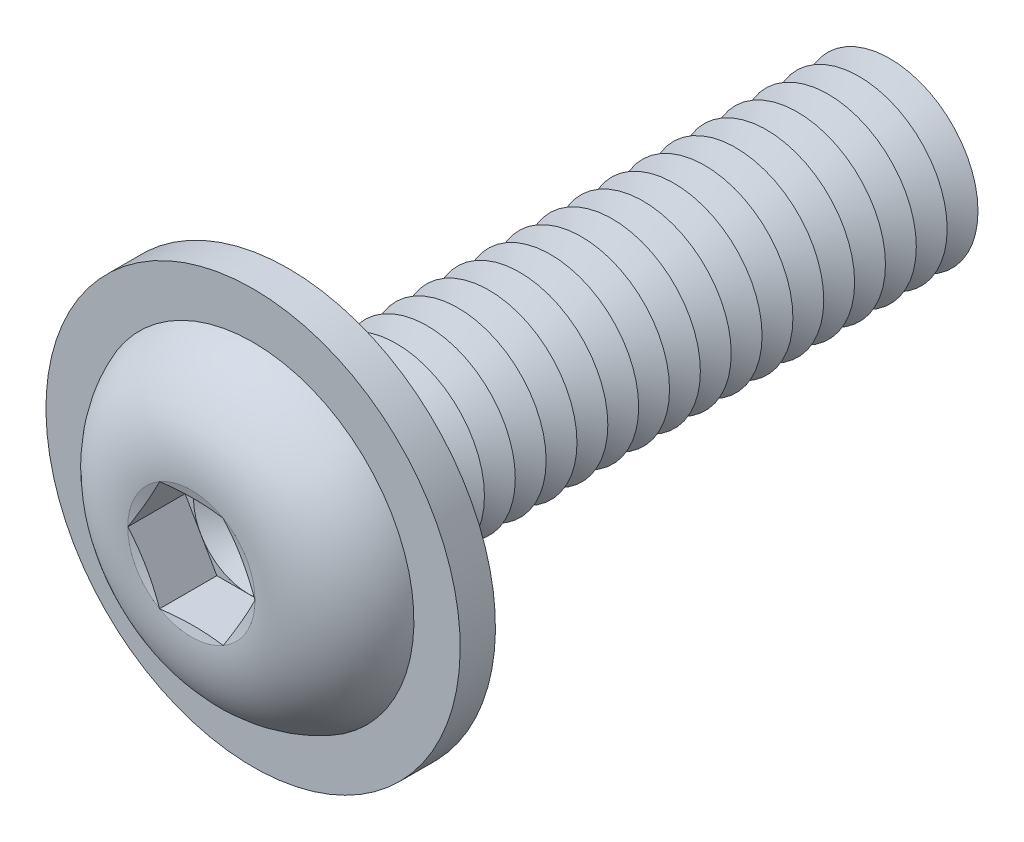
from build123d import *

# Parameters (mm, degrees)
FILLET1_R           = 0.35
LPATTERN1_COUNT     = 20
LPATTERN1_PITCH     = 0.7
CUT_EXTRUDE1_DEPTH  = 1.3
SKETCH5_R           = 4.7
SKETCH5_R_2         = 2.35
BOSS_EXTRUDE1_DEPTH = 0.8


with BuildPart() as part:
    # Sketch1 → Revolve1 (revolve)
    with BuildSketch(Plane(origin=(0, 0, 0), x_dir=(0, 0, -1), z_dir=(1, 0, 0)), mode=Mode.PRIVATE) as revolve1_sk:
        with BuildLine():
            Line((0, 2), (0, 3.8))
            ThreePointArc((0, 3.8), (-1.611961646, 3.099623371), (-2.2, 1.443375))
            Line((-2.2, 1.443375), (-2.006624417, 0.7216875))
            Line((-2.006624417, 0.7216875), (-2.2, 0.7216875))
            Line((-2.2, 0.7216875), (-2.2, 0))
            Line((-2.2, 0), (14, 0))
            Line((14, 0), (14, 2))
            Line((14, 2), (0, 2))
        make_face()
    revolve(revolve1_sk.sketch.rotate(Axis((0, 0, -14), (0, 0, 1)), 90), axis=Axis((0, 0, -14), (0, 0, 1)))

    # Fillet1
    fillet1_edges = [part.edges().sort_by_distance(p)[0] for p in [
        (2, 0, 0),
    ]]
    fillet(fillet1_edges, radius=FILLET1_R)

    # Sketch2 → Cut-Revolve1 (revolve, cut)
    with BuildSketch(Plane(origin=(0, 0, 0), x_dir=(0, 0, -1), z_dir=(1, 0, 0)), mode=Mode.PRIVATE) as cut_revolve1_sk:
        Polygon((13.65, 2), (14.35, 2), (14, 1.393782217), align=None)
    cut_revolve1 = revolve(cut_revolve1_sk.sketch.rotate(Axis((0, 0, -14), (0, 0, -1)), 270), axis=Axis((0, 0, -14), (0, 0, -1)), mode=Mode.SUBTRACT)

    # LPattern1: Cut-Revolve1 ×20
    with Locations(*[(0, 0, i * LPATTERN1_PITCH) for i in range(1, LPATTERN1_COUNT)]):
        add(cut_revolve1, mode=Mode.SUBTRACT)

    # Sketch3 → Cut-Extrude1 (cut)
    with BuildSketch(Plane.XY.offset(2.2)):
        Polygon((0.7216875, 1.249999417), (-0.7216875, 1.249999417), (-1.443375, 0), (-0.7216875, -1.249999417), (0.7216875, -1.249999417), (1.443375, 0), align=None)
    extrude(amount=-CUT_EXTRUDE1_DEPTH, mode=Mode.SUBTRACT)

    # Cut-Extrude2 cone 1 section (on through the dimple's axis) → Cut-Extrude2 (revolve, cut)
    with BuildSketch(Plane(origin=(0, 0, 0.9), x_dir=(0, -1, 0), z_dir=(1, 0, 0))):
        Polygon((0, 0), (1.249999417, 0), (0, 0.7216875), align=None)
    revolve(axis=Axis((0, 0, 0.9), (0, 0, -1)), mode=Mode.SUBTRACT)

    # Sketch5 → Boss-Extrude1 (add)
    with BuildSketch(Plane(origin=(0, 0, 0), x_dir=(-1, 0, 0), z_dir=(0, 0, -1))):
        with Locations(Location((0, 0, 0), (0, 0, 90))):
            Circle(SKETCH5_R)
        Circle(SKETCH5_R_2, mode=Mode.SUBTRACT)
    extrude(amount=-BOSS_EXTRUDE1_DEPTH)


solid = part.part
